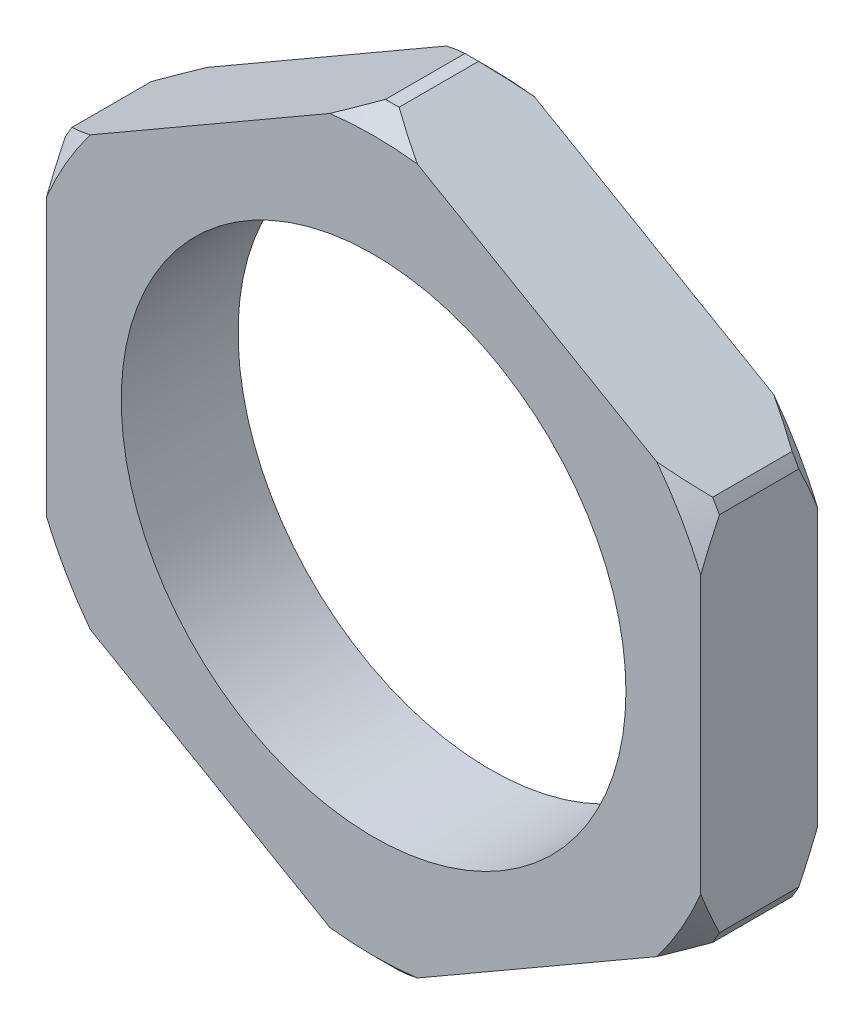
ISO-10303-21;
HEADER;
FILE_DESCRIPTION(('STEP AP214'),'2;1');
FILE_NAME('part.step','',(''),(''),'','','');
FILE_SCHEMA(('AUTOMOTIVE_DESIGN { 1 0 10303 214 1 1 1 1 }'));
ENDSEC;
DATA;
#1=APPLICATION_CONTEXT('core data for automotive mechanical design processes');
#2=APPLICATION_PROTOCOL_DEFINITION('international standard','automotive_design',2000,#1);
#3=PRODUCT_CONTEXT('',#1,'mechanical');
#4=PRODUCT('Part','Part','',(#3));
#5=PRODUCT_RELATED_PRODUCT_CATEGORY('part','',(#4));
#6=PRODUCT_DEFINITION_FORMATION('','',#4);
#7=PRODUCT_DEFINITION_CONTEXT('part definition',#1,'design');
#8=PRODUCT_DEFINITION('design','',#6,#7);
#9=PRODUCT_DEFINITION_SHAPE('','',#8);
#10=(LENGTH_UNIT() NAMED_UNIT(*) SI_UNIT(.MILLI.,.METRE.));
#11=(NAMED_UNIT(*) PLANE_ANGLE_UNIT() SI_UNIT($,.RADIAN.));
#12=(NAMED_UNIT(*) SI_UNIT($,.STERADIAN.) SOLID_ANGLE_UNIT());
#13=UNCERTAINTY_MEASURE_WITH_UNIT(LENGTH_MEASURE(1.E-05),#10,'distance_accuracy_value','');
#14=(GEOMETRIC_REPRESENTATION_CONTEXT(3) GLOBAL_UNCERTAINTY_ASSIGNED_CONTEXT((#13)) GLOBAL_UNIT_ASSIGNED_CONTEXT((#10,
#11,#12)) REPRESENTATION_CONTEXT('',''));
#15=CARTESIAN_POINT('',(0.,0.,0.));
#16=DIRECTION('',(0.,0.,1.));
#17=DIRECTION('',(1.,0.,0.));
#18=AXIS2_PLACEMENT_3D('',#15,#16,#17);
#19=CARTESIAN_POINT('',(0.,0.,2.5));
#20=DIRECTION('',(0.,0.,-1.));
#21=DIRECTION('',(-1.,0.,0.));
#22=AXIS2_PLACEMENT_3D('',#19,#20,#21);
#23=CYLINDRICAL_SURFACE('',#22,8.);
#24=DIRECTION('',(0.,0.,-1.));
#25=VECTOR('',#24,1.);
#26=CARTESIAN_POINT('',(6.85410196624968,4.12568615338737,2.5));
#27=LINE('',#26,#25);
#28=CARTESIAN_POINT('',(6.85410196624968,4.12568615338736,2.1));
#29=VERTEX_POINT('',#28);
#30=CARTESIAN_POINT('',(6.85410196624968,4.12568615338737,0.400000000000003));
#31=VERTEX_POINT('',#30);
#32=EDGE_CURVE('E425',#29,#31,#27,.T.);
#33=ORIENTED_EDGE('',*,*,#32,.F.);
#34=CARTESIAN_POINT('',(0.,0.,2.1));
#35=DIRECTION('',(0.,0.,1.));
#36=DIRECTION('',(1.,0.,0.));
#37=AXIS2_PLACEMENT_3D('',#34,#35,#36);
#38=CIRCLE('',#37,8.);
#39=CARTESIAN_POINT('',(7.,3.87298334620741,2.1));
#40=VERTEX_POINT('',#39);
#41=EDGE_CURVE('E420',#29,#40,#38,.F.);
#42=ORIENTED_EDGE('',*,*,#41,.T.);
#43=DIRECTION('',(0.,0.,-1.));
#44=VECTOR('',#43,1.);
#45=CARTESIAN_POINT('',(7.,3.87298334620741,2.5));
#46=LINE('',#45,#44);
#47=CARTESIAN_POINT('',(7.,3.87298334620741,0.400000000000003));
#48=VERTEX_POINT('',#47);
#49=EDGE_CURVE('E72',#48,#40,#46,.F.);
#50=ORIENTED_EDGE('',*,*,#49,.F.);
#51=CARTESIAN_POINT('',(0.,0.,0.400000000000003));
#52=DIRECTION('',(0.,0.,1.));
#53=DIRECTION('',(1.,0.,0.));
#54=AXIS2_PLACEMENT_3D('',#51,#52,#53);
#55=CIRCLE('',#54,8.);
#56=EDGE_CURVE('E426',#48,#31,#55,.T.);
#57=ORIENTED_EDGE('',*,*,#56,.T.);
#58=EDGE_LOOP('',(#33,#42,#50,#57));
#59=FACE_BOUND('',#58,.T.);
#60=ADVANCED_FACE('F50',(#59),#23,.T.);
#61=DIRECTION('',(0.,0.,-1.));
#62=VECTOR('',#61,1.);
#63=CARTESIAN_POINT('',(0.145898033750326,7.99866949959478,2.5));
#64=LINE('',#63,#62);
#65=CARTESIAN_POINT('',(0.145898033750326,7.99866949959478,0.400000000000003));
#66=VERTEX_POINT('',#65);
#67=CARTESIAN_POINT('',(0.145898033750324,7.99866949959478,2.1));
#68=VERTEX_POINT('',#67);
#69=EDGE_CURVE('E80',#66,#68,#64,.F.);
#70=ORIENTED_EDGE('',*,*,#69,.F.);
#71=CARTESIAN_POINT('',(-0.145898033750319,7.99866949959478,0.400000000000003));
#72=VERTEX_POINT('',#71);
#73=EDGE_CURVE('E429',#66,#72,#55,.T.);
#74=ORIENTED_EDGE('',*,*,#73,.T.);
#75=DIRECTION('',(0.,0.,-1.));
#76=VECTOR('',#75,1.);
#77=CARTESIAN_POINT('',(-0.145898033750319,7.99866949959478,2.5));
#78=LINE('',#77,#76);
#79=CARTESIAN_POINT('',(-0.145898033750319,7.99866949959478,2.1));
#80=VERTEX_POINT('',#79);
#81=EDGE_CURVE('E282',#80,#72,#78,.T.);
#82=ORIENTED_EDGE('',*,*,#81,.F.);
#83=EDGE_CURVE('E237',#80,#68,#38,.F.);
#84=ORIENTED_EDGE('',*,*,#83,.T.);
#85=EDGE_LOOP('',(#70,#74,#82,#84));
#86=FACE_BOUND('',#85,.T.);
#87=ADVANCED_FACE('F384',(#86),#23,.T.);
#88=DIRECTION('',(0.,0.,-1.));
#89=VECTOR('',#88,1.);
#90=CARTESIAN_POINT('',(7.,-3.87298334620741,2.5));
#91=LINE('',#90,#89);
#92=CARTESIAN_POINT('',(7.,-3.87298334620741,2.1));
#93=VERTEX_POINT('',#92);
#94=CARTESIAN_POINT('',(7.,-3.87298334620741,0.400000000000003));
#95=VERTEX_POINT('',#94);
#96=EDGE_CURVE('E339',#93,#95,#91,.T.);
#97=ORIENTED_EDGE('',*,*,#96,.F.);
#98=CARTESIAN_POINT('',(6.85410196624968,-4.12568615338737,2.1));
#99=VERTEX_POINT('',#98);
#100=EDGE_CURVE('E421',#93,#99,#38,.F.);
#101=ORIENTED_EDGE('',*,*,#100,.T.);
#102=DIRECTION('',(0.,0.,-1.));
#103=VECTOR('',#102,1.);
#104=CARTESIAN_POINT('',(6.85410196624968,-4.12568615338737,2.5));
#105=LINE('',#104,#103);
#106=CARTESIAN_POINT('',(6.85410196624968,-4.12568615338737,0.400000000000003));
#107=VERTEX_POINT('',#106);
#108=EDGE_CURVE('E462',#107,#99,#105,.F.);
#109=ORIENTED_EDGE('',*,*,#108,.F.);
#110=EDGE_CURVE('E424',#107,#95,#55,.T.);
#111=ORIENTED_EDGE('',*,*,#110,.T.);
#112=EDGE_LOOP('',(#97,#101,#109,#111));
#113=FACE_BOUND('',#112,.T.);
#114=ADVANCED_FACE('F390',(#113),#23,.T.);
#115=DIRECTION('',(0.,0.,-1.));
#116=VECTOR('',#115,1.);
#117=CARTESIAN_POINT('',(0.145898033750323,-7.99866949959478,2.5));
#118=LINE('',#117,#116);
#119=CARTESIAN_POINT('',(0.145898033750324,-7.99866949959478,2.1));
#120=VERTEX_POINT('',#119);
#121=CARTESIAN_POINT('',(0.145898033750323,-7.99866949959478,0.400000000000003));
#122=VERTEX_POINT('',#121);
#123=EDGE_CURVE('E720',#120,#122,#118,.T.);
#124=ORIENTED_EDGE('',*,*,#123,.F.);
#125=CARTESIAN_POINT('',(-0.145898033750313,-7.99866949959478,2.1));
#126=VERTEX_POINT('',#125);
#127=EDGE_CURVE('E419',#120,#126,#38,.F.);
#128=ORIENTED_EDGE('',*,*,#127,.T.);
#129=DIRECTION('',(0.,0.,-1.));
#130=VECTOR('',#129,1.);
#131=CARTESIAN_POINT('',(-0.145898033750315,-7.99866949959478,2.5));
#132=LINE('',#131,#130);
#133=CARTESIAN_POINT('',(-0.145898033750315,-7.99866949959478,0.400000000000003));
#134=VERTEX_POINT('',#133);
#135=EDGE_CURVE('E464',#134,#126,#132,.F.);
#136=ORIENTED_EDGE('',*,*,#135,.F.);
#137=EDGE_CURVE('E435',#134,#122,#55,.T.);
#138=ORIENTED_EDGE('',*,*,#137,.T.);
#139=EDGE_LOOP('',(#124,#128,#136,#138));
#140=FACE_BOUND('',#139,.T.);
#141=ADVANCED_FACE('F401',(#140),#23,.T.);
#142=DIRECTION('',(0.,0.,-1.));
#143=VECTOR('',#142,1.);
#144=CARTESIAN_POINT('',(-6.85410196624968,-4.12568615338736,2.5));
#145=LINE('',#144,#143);
#146=CARTESIAN_POINT('',(-6.85410196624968,-4.12568615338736,2.1));
#147=VERTEX_POINT('',#146);
#148=CARTESIAN_POINT('',(-6.85410196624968,-4.12568615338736,0.400000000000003));
#149=VERTEX_POINT('',#148);
#150=EDGE_CURVE('E450',#147,#149,#145,.T.);
#151=ORIENTED_EDGE('',*,*,#150,.F.);
#152=CARTESIAN_POINT('',(-7.,-3.87298334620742,2.1));
#153=VERTEX_POINT('',#152);
#154=EDGE_CURVE('E416',#147,#153,#38,.F.);
#155=ORIENTED_EDGE('',*,*,#154,.T.);
#156=DIRECTION('',(0.,0.,-1.));
#157=VECTOR('',#156,1.);
#158=CARTESIAN_POINT('',(-7.,-3.87298334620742,2.5));
#159=LINE('',#158,#157);
#160=CARTESIAN_POINT('',(-7.,-3.87298334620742,0.400000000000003));
#161=VERTEX_POINT('',#160);
#162=EDGE_CURVE('E452',#161,#153,#159,.F.);
#163=ORIENTED_EDGE('',*,*,#162,.F.);
#164=EDGE_CURVE('E441',#161,#149,#55,.T.);
#165=ORIENTED_EDGE('',*,*,#164,.T.);
#166=EDGE_LOOP('',(#151,#155,#163,#165));
#167=FACE_BOUND('',#166,.T.);
#168=ADVANCED_FACE('F394',(#167),#23,.T.);
#169=DIRECTION('',(0.,0.,-1.));
#170=VECTOR('',#169,1.);
#171=CARTESIAN_POINT('',(-7.,3.87298334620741,2.5));
#172=LINE('',#171,#170);
#173=CARTESIAN_POINT('',(-7.,3.87298334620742,2.1));
#174=VERTEX_POINT('',#173);
#175=CARTESIAN_POINT('',(-7.,3.87298334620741,0.400000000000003));
#176=VERTEX_POINT('',#175);
#177=EDGE_CURVE('E406',#174,#176,#172,.T.);
#178=ORIENTED_EDGE('',*,*,#177,.F.);
#179=CARTESIAN_POINT('',(-6.85410196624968,4.12568615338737,2.1));
#180=VERTEX_POINT('',#179);
#181=EDGE_CURVE('E409',#174,#180,#38,.F.);
#182=ORIENTED_EDGE('',*,*,#181,.T.);
#183=DIRECTION('',(0.,0.,-1.));
#184=VECTOR('',#183,1.);
#185=CARTESIAN_POINT('',(-6.85410196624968,4.12568615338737,2.5));
#186=LINE('',#185,#184);
#187=CARTESIAN_POINT('',(-6.85410196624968,4.12568615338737,0.400000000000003));
#188=VERTEX_POINT('',#187);
#189=EDGE_CURVE('E283',#188,#180,#186,.F.);
#190=ORIENTED_EDGE('',*,*,#189,.F.);
#191=EDGE_CURVE('E411',#188,#176,#55,.T.);
#192=ORIENTED_EDGE('',*,*,#191,.T.);
#193=EDGE_LOOP('',(#178,#182,#190,#192));
#194=FACE_BOUND('',#193,.T.);
#195=ADVANCED_FACE('F386',(#194),#23,.T.);
#196=CARTESIAN_POINT('',(0.,0.,2.5));
#197=DIRECTION('',(0.,0.,1.));
#198=DIRECTION('',(1.,0.,0.));
#199=AXIS2_PLACEMENT_3D('',#196,#197,#198);
#200=PLANE('',#199);
#201=CARTESIAN_POINT('',(0.,0.,2.5));
#202=DIRECTION('',(0.,0.,1.));
#203=DIRECTION('',(1.,0.,0.));
#204=AXIS2_PLACEMENT_3D('',#201,#202,#203);
#205=CIRCLE('',#204,5.4);
#206=CARTESIAN_POINT('',(5.4,0.,2.5));
#207=VERTEX_POINT('',#206);
#208=EDGE_CURVE('E517',#207,#207,#205,.T.);
#209=ORIENTED_EDGE('',*,*,#208,.F.);
#210=EDGE_LOOP('',(#209));
#211=FACE_BOUND('',#210,.T.);
#212=CARTESIAN_POINT('',(0.,0.,2.5));
#213=DIRECTION('',(0.,0.,1.));
#214=DIRECTION('',(1.,0.,0.));
#215=AXIS2_PLACEMENT_3D('',#212,#213,#214);
#216=CIRCLE('',#215,7.6);
#217=CARTESIAN_POINT('',(7.,2.95972971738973,2.5));
#218=VERTEX_POINT('',#217);
#219=CARTESIAN_POINT('',(6.06320112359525,4.5823129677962,2.5));
#220=VERTEX_POINT('',#219);
#221=EDGE_CURVE('E243',#218,#220,#216,.T.);
#222=ORIENTED_EDGE('',*,*,#221,.T.);
#223=DIRECTION('',(-0.866025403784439,0.5,0.));
#224=VECTOR('',#223,1.);
#225=CARTESIAN_POINT('',(7.,4.04145188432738,2.5));
#226=LINE('',#225,#224);
#227=CARTESIAN_POINT('',(0.936798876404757,7.54204268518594,2.5));
#228=VERTEX_POINT('',#227);
#229=EDGE_CURVE('E229',#220,#228,#226,.T.);
#230=ORIENTED_EDGE('',*,*,#229,.T.);
#231=CARTESIAN_POINT('',(-0.936798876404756,7.54204268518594,2.5));
#232=VERTEX_POINT('',#231);
#233=EDGE_CURVE('E235',#228,#232,#216,.T.);
#234=ORIENTED_EDGE('',*,*,#233,.T.);
#235=DIRECTION('',(-0.866025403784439,-0.5,0.));
#236=VECTOR('',#235,1.);
#237=CARTESIAN_POINT('',(0.,8.08290376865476,2.5));
#238=LINE('',#237,#236);
#239=CARTESIAN_POINT('',(-6.06320112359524,4.58231296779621,2.5));
#240=VERTEX_POINT('',#239);
#241=EDGE_CURVE('E217',#232,#240,#238,.T.);
#242=ORIENTED_EDGE('',*,*,#241,.T.);
#243=CARTESIAN_POINT('',(-7.,2.95972971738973,2.5));
#244=VERTEX_POINT('',#243);
#245=EDGE_CURVE('E244',#240,#244,#216,.T.);
#246=ORIENTED_EDGE('',*,*,#245,.T.);
#247=DIRECTION('',(0.,-1.,0.));
#248=VECTOR('',#247,1.);
#249=CARTESIAN_POINT('',(-7.,4.04145188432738,2.5));
#250=LINE('',#249,#248);
#251=CARTESIAN_POINT('',(-7.,-2.95972971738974,2.5));
#252=VERTEX_POINT('',#251);
#253=EDGE_CURVE('E228',#244,#252,#250,.T.);
#254=ORIENTED_EDGE('',*,*,#253,.T.);
#255=CARTESIAN_POINT('',(-6.06320112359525,-4.5823129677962,2.5));
#256=VERTEX_POINT('',#255);
#257=EDGE_CURVE('E247',#252,#256,#216,.T.);
#258=ORIENTED_EDGE('',*,*,#257,.T.);
#259=DIRECTION('',(0.866025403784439,-0.5,0.));
#260=VECTOR('',#259,1.);
#261=CARTESIAN_POINT('',(-7.,-4.04145188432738,2.5));
#262=LINE('',#261,#260);
#263=CARTESIAN_POINT('',(-0.936798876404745,-7.54204268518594,2.5));
#264=VERTEX_POINT('',#263);
#265=EDGE_CURVE('E503',#256,#264,#262,.T.);
#266=ORIENTED_EDGE('',*,*,#265,.T.);
#267=CARTESIAN_POINT('',(0.936798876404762,-7.54204268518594,2.5));
#268=VERTEX_POINT('',#267);
#269=EDGE_CURVE('E493',#264,#268,#216,.T.);
#270=ORIENTED_EDGE('',*,*,#269,.T.);
#271=DIRECTION('',(0.866025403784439,0.5,0.));
#272=VECTOR('',#271,1.);
#273=CARTESIAN_POINT('',(0.,-8.08290376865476,2.5));
#274=LINE('',#273,#272);
#275=CARTESIAN_POINT('',(6.06320112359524,-4.58231296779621,2.5));
#276=VERTEX_POINT('',#275);
#277=EDGE_CURVE('E507',#268,#276,#274,.T.);
#278=ORIENTED_EDGE('',*,*,#277,.T.);
#279=CARTESIAN_POINT('',(7.,-2.95972971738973,2.5));
#280=VERTEX_POINT('',#279);
#281=EDGE_CURVE('E246',#276,#280,#216,.T.);
#282=ORIENTED_EDGE('',*,*,#281,.T.);
#283=DIRECTION('',(0.,1.,0.));
#284=VECTOR('',#283,1.);
#285=CARTESIAN_POINT('',(7.,-4.04145188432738,2.5));
#286=LINE('',#285,#284);
#287=EDGE_CURVE('E509',#280,#218,#286,.T.);
#288=ORIENTED_EDGE('',*,*,#287,.T.);
#289=EDGE_LOOP('',(#222,#230,#234,#242,#246,#254,#258,#266,#270,#278,#282,#288));
#290=FACE_BOUND('',#289,.T.);
#291=ADVANCED_FACE('F242',(#211,#290),#200,.T.);
#292=CARTESIAN_POINT('',(0.,0.,0.));
#293=DIRECTION('',(0.,0.,1.));
#294=DIRECTION('',(1.,0.,0.));
#295=AXIS2_PLACEMENT_3D('',#292,#293,#294);
#296=PLANE('',#295);
#297=CARTESIAN_POINT('',(0.,0.,0.));
#298=DIRECTION('',(0.,0.,1.));
#299=DIRECTION('',(1.,0.,0.));
#300=AXIS2_PLACEMENT_3D('',#297,#298,#299);
#301=CIRCLE('',#300,5.4);
#302=CARTESIAN_POINT('',(5.4,0.,0.));
#303=VERTEX_POINT('',#302);
#304=EDGE_CURVE('E527',#303,#303,#301,.T.);
#305=ORIENTED_EDGE('',*,*,#304,.T.);
#306=EDGE_LOOP('',(#305));
#307=FACE_BOUND('',#306,.T.);
#308=DIRECTION('',(-0.866025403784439,0.5,0.));
#309=VECTOR('',#308,1.);
#310=CARTESIAN_POINT('',(7.,4.04145188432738,0.));
#311=LINE('',#310,#309);
#312=CARTESIAN_POINT('',(6.06320112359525,4.5823129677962,0.));
#313=VERTEX_POINT('',#312);
#314=CARTESIAN_POINT('',(0.936798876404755,7.54204268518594,0.));
#315=VERTEX_POINT('',#314);
#316=EDGE_CURVE('E481',#313,#315,#311,.T.);
#317=ORIENTED_EDGE('',*,*,#316,.F.);
#318=CARTESIAN_POINT('',(0.,0.,0.));
#319=DIRECTION('',(0.,0.,1.));
#320=DIRECTION('',(1.,0.,0.));
#321=AXIS2_PLACEMENT_3D('',#318,#319,#320);
#322=CIRCLE('',#321,7.6);
#323=CARTESIAN_POINT('',(7.,2.95972971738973,0.));
#324=VERTEX_POINT('',#323);
#325=EDGE_CURVE('E428',#313,#324,#322,.F.);
#326=ORIENTED_EDGE('',*,*,#325,.T.);
#327=DIRECTION('',(0.,1.,0.));
#328=VECTOR('',#327,1.);
#329=CARTESIAN_POINT('',(7.,-4.04145188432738,0.));
#330=LINE('',#329,#328);
#331=CARTESIAN_POINT('',(7.,-2.95972971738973,0.));
#332=VERTEX_POINT('',#331);
#333=EDGE_CURVE('E525',#332,#324,#330,.T.);
#334=ORIENTED_EDGE('',*,*,#333,.F.);
#335=CARTESIAN_POINT('',(6.06320112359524,-4.58231296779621,0.));
#336=VERTEX_POINT('',#335);
#337=EDGE_CURVE('E249',#332,#336,#322,.F.);
#338=ORIENTED_EDGE('',*,*,#337,.T.);
#339=DIRECTION('',(0.866025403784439,0.5,0.));
#340=VECTOR('',#339,1.);
#341=CARTESIAN_POINT('',(0.,-8.08290376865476,0.));
#342=LINE('',#341,#340);
#343=CARTESIAN_POINT('',(0.936798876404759,-7.54204268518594,0.));
#344=VERTEX_POINT('',#343);
#345=EDGE_CURVE('E523',#344,#336,#342,.T.);
#346=ORIENTED_EDGE('',*,*,#345,.F.);
#347=CARTESIAN_POINT('',(-0.936798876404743,-7.54204268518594,0.));
#348=VERTEX_POINT('',#347);
#349=EDGE_CURVE('E487',#344,#348,#322,.F.);
#350=ORIENTED_EDGE('',*,*,#349,.T.);
#351=DIRECTION('',(0.866025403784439,-0.5,0.));
#352=VECTOR('',#351,1.);
#353=CARTESIAN_POINT('',(-7.,-4.04145188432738,0.));
#354=LINE('',#353,#352);
#355=CARTESIAN_POINT('',(-6.06320112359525,-4.5823129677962,0.));
#356=VERTEX_POINT('',#355);
#357=EDGE_CURVE('E521',#356,#348,#354,.T.);
#358=ORIENTED_EDGE('',*,*,#357,.F.);
#359=CARTESIAN_POINT('',(-7.,-2.95972971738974,0.));
#360=VERTEX_POINT('',#359);
#361=EDGE_CURVE('E460',#356,#360,#322,.F.);
#362=ORIENTED_EDGE('',*,*,#361,.T.);
#363=DIRECTION('',(0.,-1.,0.));
#364=VECTOR('',#363,1.);
#365=CARTESIAN_POINT('',(-7.,4.04145188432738,0.));
#366=LINE('',#365,#364);
#367=CARTESIAN_POINT('',(-7.,2.95972971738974,0.));
#368=VERTEX_POINT('',#367);
#369=EDGE_CURVE('E514',#368,#360,#366,.T.);
#370=ORIENTED_EDGE('',*,*,#369,.F.);
#371=CARTESIAN_POINT('',(-6.06320112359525,4.58231296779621,0.));
#372=VERTEX_POINT('',#371);
#373=EDGE_CURVE('E485',#368,#372,#322,.F.);
#374=ORIENTED_EDGE('',*,*,#373,.T.);
#375=DIRECTION('',(-0.866025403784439,-0.5,0.));
#376=VECTOR('',#375,1.);
#377=CARTESIAN_POINT('',(0.,8.08290376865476,0.));
#378=LINE('',#377,#376);
#379=CARTESIAN_POINT('',(-0.936798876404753,7.54204268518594,0.));
#380=VERTEX_POINT('',#379);
#381=EDGE_CURVE('E484',#380,#372,#378,.T.);
#382=ORIENTED_EDGE('',*,*,#381,.F.);
#383=EDGE_CURVE('E432',#380,#315,#322,.F.);
#384=ORIENTED_EDGE('',*,*,#383,.T.);
#385=EDGE_LOOP('',(#317,#326,#334,#338,#346,#350,#358,#362,#370,#374,#382,#384));
#386=FACE_BOUND('',#385,.T.);
#387=ADVANCED_FACE('F295',(#307,#386),#296,.F.);
#388=CARTESIAN_POINT('',(0.,0.,0.400000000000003));
#389=DIRECTION('',(0.,0.,1.));
#390=DIRECTION('',(1.,0.,0.));
#391=AXIS2_PLACEMENT_3D('',#388,#389,#390);
#392=CONICAL_SURFACE('',#391,8.,0.785398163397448);
#393=ORIENTED_EDGE('',*,*,#73,.F.);
#394=CARTESIAN_POINT('',(0.144646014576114,7.99939235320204,0.400700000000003));
#395=CARTESIAN_POINT('',(0.260798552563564,7.93233165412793,0.335758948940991));
#396=CARTESIAN_POINT('',(0.377823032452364,7.86476753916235,0.272893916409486));
#397=CARTESIAN_POINT('',(0.613766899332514,7.72854528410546,0.151915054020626));
#398=CARTESIAN_POINT('',(0.732687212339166,7.65988660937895,0.0938036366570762));
#399=CARTESIAN_POINT('',(1.09348058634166,7.45158245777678,-0.0729312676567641));
#400=CARTESIAN_POINT('',(1.33828379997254,7.31024525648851,-0.173325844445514));
#401=CARTESIAN_POINT('',(1.83183194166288,7.02529510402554,-0.344803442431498));
#402=CARTESIAN_POINT('',(2.08046910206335,6.88174437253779,-0.416288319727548));
#403=CARTESIAN_POINT('',(2.45720328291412,6.66423679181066,-0.498619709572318));
#404=CARTESIAN_POINT('',(2.58330119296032,6.59143412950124,-0.521904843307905));
#405=CARTESIAN_POINT('',(2.83647219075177,6.44526578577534,-0.559685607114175));
#406=CARTESIAN_POINT('',(2.96354515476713,6.37190017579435,-0.574182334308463));
#407=CARTESIAN_POINT('',(3.28037427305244,6.18897879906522,-0.598802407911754));
#408=CARTESIAN_POINT('',(3.4704793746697,6.07922156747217,-0.603345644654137));
#409=CARTESIAN_POINT('',(3.85025524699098,5.85995786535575,-0.591756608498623));
#410=CARTESIAN_POINT('',(4.03992585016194,5.75045149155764,-0.575617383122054));
#411=CARTESIAN_POINT('',(4.4173782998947,5.53252921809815,-0.523615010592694));
#412=CARTESIAN_POINT('',(4.60515817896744,5.42411445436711,-0.487733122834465));
#413=CARTESIAN_POINT('',(4.97744972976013,5.20917182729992,-0.39817761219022));
#414=CARTESIAN_POINT('',(5.16196168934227,5.10264379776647,-0.344505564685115));
#415=CARTESIAN_POINT('',(5.47473387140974,4.92206469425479,-0.239381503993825));
#416=CARTESIAN_POINT('',(5.60396477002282,4.84745320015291,-0.191699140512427));
#417=CARTESIAN_POINT('',(5.86034050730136,4.69943459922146,-0.0894080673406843));
#418=CARTESIAN_POINT('',(5.98748549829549,4.62602740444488,-0.0347998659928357));
#419=CARTESIAN_POINT('',(6.23927167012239,4.48065859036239,0.0803015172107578));
#420=CARTESIAN_POINT('',(6.36391960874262,4.40869306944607,0.14077513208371));
#421=CARTESIAN_POINT('',(6.61115417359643,4.26595212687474,0.266979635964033));
#422=CARTESIAN_POINT('',(6.73374151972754,4.19517628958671,0.332708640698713));
#423=CARTESIAN_POINT('',(6.85535398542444,4.12496329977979,0.40070000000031));
#424=B_SPLINE_CURVE_WITH_KNOTS('',3,(#394,#395,#396,#397,#398,#399,#400,#401,#402,#403,#404,
#405,#406,#407,#408,#409,#410,#411,#412,#413,#414,#415,#416,#417,#418,#419,#420,#421,#422,#423),
.UNSPECIFIED.,.F.,.F.,(4,2,2,2,2,2,2,2,2,2,2,2,2,2,4),(0.,0.447022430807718,0.894270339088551,
1.79301544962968,2.67879864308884,3.12093161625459,3.56300938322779,4.22066809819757,
4.87854794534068,5.53705336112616,6.19550047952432,6.66529864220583,7.13506234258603,
7.60330955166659,8.07138962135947),.UNSPECIFIED.);
#425=EDGE_CURVE('E476',#66,#315,#424,.T.);
#426=ORIENTED_EDGE('',*,*,#425,.T.);
#427=ORIENTED_EDGE('',*,*,#383,.F.);
#428=CARTESIAN_POINT('',(-6.85535398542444,4.12496329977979,0.40070000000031));
#429=CARTESIAN_POINT('',(-6.73920144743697,4.19202399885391,0.33575894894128));
#430=CARTESIAN_POINT('',(-6.62217696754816,4.2595881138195,0.272893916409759));
#431=CARTESIAN_POINT('',(-6.38623310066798,4.39581036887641,0.151915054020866));
#432=CARTESIAN_POINT('',(-6.26731278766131,4.46446904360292,0.093803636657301));
#433=CARTESIAN_POINT('',(-5.90651941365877,4.67277319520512,-0.0729312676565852));
#434=CARTESIAN_POINT('',(-5.66171620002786,4.81411039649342,-0.173325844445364));
#435=CARTESIAN_POINT('',(-5.16816805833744,5.09906054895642,-0.3448034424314));
#436=CARTESIAN_POINT('',(-4.91953089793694,5.24261128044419,-0.416288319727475));
#437=CARTESIAN_POINT('',(-4.54279671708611,5.46011886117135,-0.498619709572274));
#438=CARTESIAN_POINT('',(-4.41669880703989,5.53292152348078,-0.52190484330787));
#439=CARTESIAN_POINT('',(-4.1635278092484,5.67908986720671,-0.559685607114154));
#440=CARTESIAN_POINT('',(-4.03645484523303,5.75245547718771,-0.574182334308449));
#441=CARTESIAN_POINT('',(-3.7196257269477,5.93537685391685,-0.59880240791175));
#442=CARTESIAN_POINT('',(-3.52952062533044,6.0451340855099,-0.603345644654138));
#443=CARTESIAN_POINT('',(-3.14974475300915,6.26439778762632,-0.591756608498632));
#444=CARTESIAN_POINT('',(-2.96007414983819,6.37390416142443,-0.575617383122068));
#445=CARTESIAN_POINT('',(-2.58262170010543,6.59182643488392,-0.523615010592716));
#446=CARTESIAN_POINT('',(-2.39484182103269,6.70024119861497,-0.487733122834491));
#447=CARTESIAN_POINT('',(-2.02255027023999,6.91518382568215,-0.398177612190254));
#448=CARTESIAN_POINT('',(-1.83803831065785,7.02171185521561,-0.344505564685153));
#449=CARTESIAN_POINT('',(-1.52526612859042,7.20229095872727,-0.23938150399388));
#450=CARTESIAN_POINT('',(-1.39603522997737,7.27690245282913,-0.1916991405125));
#451=CARTESIAN_POINT('',(-1.13965949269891,7.42492105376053,-0.0894080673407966));
#452=CARTESIAN_POINT('',(-1.01251450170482,7.49832824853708,-0.0347998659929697));
#453=CARTESIAN_POINT('',(-0.760728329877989,7.64369706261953,0.0803015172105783));
#454=CARTESIAN_POINT('',(-0.636080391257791,7.71566258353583,0.140775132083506));
#455=CARTESIAN_POINT('',(-0.388845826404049,7.85840352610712,0.266979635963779));
#456=CARTESIAN_POINT('',(-0.266258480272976,7.92917936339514,0.332708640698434));
#457=CARTESIAN_POINT('',(-0.144646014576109,7.99939235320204,0.400700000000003));
#458=B_SPLINE_CURVE_WITH_KNOTS('',3,(#428,#429,#430,#431,#432,#433,#434,#435,#436,#437,#438,
#439,#440,#441,#442,#443,#444,#445,#446,#447,#448,#449,#450,#451,#452,#453,#454,#455,#456,#457),
.UNSPECIFIED.,.F.,.F.,(4,2,2,2,2,2,2,2,2,2,2,2,2,2,4),(0.,0.447022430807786,0.894270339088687,
1.79301544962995,2.67879864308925,3.12093161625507,3.56300938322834,4.22066809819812,
4.87854794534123,5.53705336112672,6.19550047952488,6.66529864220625,7.13506234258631,
7.60330955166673,8.07138962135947),.UNSPECIFIED.);
#459=EDGE_CURVE('E284',#380,#72,#458,.T.);
#460=ORIENTED_EDGE('',*,*,#459,.T.);
#461=EDGE_LOOP('',(#393,#426,#427,#460));
#462=FACE_BOUND('',#461,.T.);
#463=ADVANCED_FACE('F288',(#462),#392,.T.);
#464=ORIENTED_EDGE('',*,*,#325,.F.);
#465=EDGE_CURVE('E478',#313,#31,#424,.T.);
#466=ORIENTED_EDGE('',*,*,#465,.T.);
#467=ORIENTED_EDGE('',*,*,#56,.F.);
#468=CARTESIAN_POINT('',(7.,3.87442905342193,0.400700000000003));
#469=CARTESIAN_POINT('',(7.,3.74030765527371,0.33575894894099));
#470=CARTESIAN_POINT('',(7.,3.60517942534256,0.272893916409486));
#471=CARTESIAN_POINT('',(7.,3.33273491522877,0.151915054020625));
#472=CARTESIAN_POINT('',(7.,3.19541756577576,0.0938036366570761));
#473=CARTESIAN_POINT('',(7.,2.77880926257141,-0.0729312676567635));
#474=CARTESIAN_POINT('',(7.,2.49613485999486,-0.173325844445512));
#475=CARTESIAN_POINT('',(7.,1.92623455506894,-0.344803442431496));
#476=CARTESIAN_POINT('',(7.,1.63913309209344,-0.416288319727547));
#477=CARTESIAN_POINT('',(7.,1.20411793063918,-0.498619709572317));
#478=CARTESIAN_POINT('',(7.,1.05851260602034,-0.521904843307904));
#479=CARTESIAN_POINT('',(7.,0.766175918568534,-0.559685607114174));
#480=CARTESIAN_POINT('',(7.,0.619444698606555,-0.574182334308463));
#481=CARTESIAN_POINT('',(7.,0.253601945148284,-0.598802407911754));
#482=CARTESIAN_POINT('',(7.,0.0340874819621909,-0.603345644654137));
#483=CARTESIAN_POINT('',(7.,-0.404439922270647,-0.591756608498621));
#484=CARTESIAN_POINT('',(7.,-0.623452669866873,-0.575617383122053));
#485=CARTESIAN_POINT('',(7.,-1.05929721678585,-0.523615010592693));
#486=CARTESIAN_POINT('',(7.,-1.27612674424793,-0.487733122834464));
#487=CARTESIAN_POINT('',(7.,-1.7060119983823,-0.398177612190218));
#488=CARTESIAN_POINT('',(7.,-1.91906805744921,-0.344505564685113));
#489=CARTESIAN_POINT('',(7.,-2.28022626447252,-0.239381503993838));
#490=CARTESIAN_POINT('',(7.,-2.42944925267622,-0.191699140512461));
#491=CARTESIAN_POINT('',(7.,-2.72548645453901,-0.0894080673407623));
#492=CARTESIAN_POINT('',(7.,-2.8723008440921,-0.0347998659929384));
#493=CARTESIAN_POINT('',(7.,-3.16303847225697,0.0803015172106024));
#494=CARTESIAN_POINT('',(7.,-3.30696951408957,0.140775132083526));
#495=CARTESIAN_POINT('',(7.,-3.59245139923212,0.26697963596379));
#496=CARTESIAN_POINT('',(7.,-3.73400307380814,0.332708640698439));
#497=CARTESIAN_POINT('',(7.,-3.87442905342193,0.400700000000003));
#498=B_SPLINE_CURVE_WITH_KNOTS('',3,(#468,#469,#470,#471,#472,#473,#474,#475,#476,#477,#478,
#479,#480,#481,#482,#483,#484,#485,#486,#487,#488,#489,#490,#491,#492,#493,#494,#495,#496,#497),
.UNSPECIFIED.,.F.,.F.,(4,2,2,2,2,2,2,2,2,2,2,2,2,2,4),(0.,0.447022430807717,0.89427033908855,
1.79301544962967,2.67879864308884,3.12093161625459,3.56300938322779,4.22066809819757,
4.87854794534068,5.53705336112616,6.19550047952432,6.66529864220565,7.13506234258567,
7.60330955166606,8.07138962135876),.UNSPECIFIED.);
#499=EDGE_CURVE('E330',#48,#324,#498,.T.);
#500=ORIENTED_EDGE('',*,*,#499,.T.);
#501=EDGE_LOOP('',(#464,#466,#467,#500));
#502=FACE_BOUND('',#501,.T.);
#503=ADVANCED_FACE('F294',(#502),#392,.T.);
#504=ORIENTED_EDGE('',*,*,#337,.F.);
#505=EDGE_CURVE('E340',#332,#95,#498,.T.);
#506=ORIENTED_EDGE('',*,*,#505,.T.);
#507=ORIENTED_EDGE('',*,*,#110,.F.);
#508=CARTESIAN_POINT('',(6.85535398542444,-4.12496329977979,0.400700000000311));
#509=CARTESIAN_POINT('',(6.73920144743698,-4.19202399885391,0.335758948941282));
#510=CARTESIAN_POINT('',(6.62217696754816,-4.2595881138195,0.272893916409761));
#511=CARTESIAN_POINT('',(6.38623310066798,-4.39581036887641,0.151915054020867));
#512=CARTESIAN_POINT('',(6.26731278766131,-4.46446904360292,0.0938036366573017));
#513=CARTESIAN_POINT('',(5.90651941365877,-4.67277319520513,-0.0729312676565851));
#514=CARTESIAN_POINT('',(5.66171620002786,-4.81411039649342,-0.173325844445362));
#515=CARTESIAN_POINT('',(5.16816805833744,-5.09906054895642,-0.344803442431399));
#516=CARTESIAN_POINT('',(4.91953089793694,-5.24261128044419,-0.416288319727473));
#517=CARTESIAN_POINT('',(4.54279671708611,-5.46011886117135,-0.498619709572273));
#518=CARTESIAN_POINT('',(4.41669880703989,-5.53292152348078,-0.521904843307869));
#519=CARTESIAN_POINT('',(4.1635278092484,-5.67908986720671,-0.559685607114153));
#520=CARTESIAN_POINT('',(4.03645484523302,-5.75245547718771,-0.574182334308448));
#521=CARTESIAN_POINT('',(3.71962572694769,-5.93537685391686,-0.598802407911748));
#522=CARTESIAN_POINT('',(3.52952062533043,-6.0451340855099,-0.603345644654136));
#523=CARTESIAN_POINT('',(3.14974475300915,-6.26439778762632,-0.591756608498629));
#524=CARTESIAN_POINT('',(2.96007414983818,-6.37390416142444,-0.575617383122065));
#525=CARTESIAN_POINT('',(2.58262170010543,-6.59182643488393,-0.523615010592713));
#526=CARTESIAN_POINT('',(2.39484182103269,-6.70024119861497,-0.487733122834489));
#527=CARTESIAN_POINT('',(2.02255027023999,-6.91518382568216,-0.39817761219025));
#528=CARTESIAN_POINT('',(1.83803831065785,-7.02171185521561,-0.344505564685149));
#529=CARTESIAN_POINT('',(1.52526612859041,-7.20229095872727,-0.239381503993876));
#530=CARTESIAN_POINT('',(1.39603522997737,-7.27690245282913,-0.191699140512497));
#531=CARTESIAN_POINT('',(1.13965949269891,-7.42492105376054,-0.0894080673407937));
#532=CARTESIAN_POINT('',(1.01251450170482,-7.49832824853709,-0.034799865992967));
#533=CARTESIAN_POINT('',(0.76072832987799,-7.64369706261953,0.0803015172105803));
#534=CARTESIAN_POINT('',(0.636080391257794,-7.71566258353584,0.140775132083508));
#535=CARTESIAN_POINT('',(0.388845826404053,-7.85840352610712,0.26697963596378));
#536=CARTESIAN_POINT('',(0.266258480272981,-7.92917936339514,0.332708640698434));
#537=CARTESIAN_POINT('',(0.144646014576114,-7.99939235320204,0.400700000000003));
#538=B_SPLINE_CURVE_WITH_KNOTS('',3,(#508,#509,#510,#511,#512,#513,#514,#515,#516,#517,#518,
#519,#520,#521,#522,#523,#524,#525,#526,#527,#528,#529,#530,#531,#532,#533,#534,#535,#536,#537),
.UNSPECIFIED.,.F.,.F.,(4,2,2,2,2,2,2,2,2,2,2,2,2,2,4),(0.,0.447022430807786,0.894270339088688,
1.79301544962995,2.67879864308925,3.12093161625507,3.56300938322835,4.22066809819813,
4.87854794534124,5.53705336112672,6.19550047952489,6.66529864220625,7.13506234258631,
7.60330955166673,8.07138962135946),.UNSPECIFIED.);
#539=EDGE_CURVE('E321',#107,#336,#538,.T.);
#540=ORIENTED_EDGE('',*,*,#539,.T.);
#541=EDGE_LOOP('',(#504,#506,#507,#540));
#542=FACE_BOUND('',#541,.T.);
#543=ADVANCED_FACE('F639',(#542),#392,.T.);
#544=ORIENTED_EDGE('',*,*,#349,.F.);
#545=EDGE_CURVE('E722',#344,#122,#538,.T.);
#546=ORIENTED_EDGE('',*,*,#545,.T.);
#547=ORIENTED_EDGE('',*,*,#137,.F.);
#548=CARTESIAN_POINT('',(-0.144646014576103,-7.99939235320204,0.400700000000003));
#549=CARTESIAN_POINT('',(-0.260798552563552,-7.93233165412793,0.33575894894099));
#550=CARTESIAN_POINT('',(-0.377823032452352,-7.86476753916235,0.272893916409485));
#551=CARTESIAN_POINT('',(-0.613766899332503,-7.72854528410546,0.151915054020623));
#552=CARTESIAN_POINT('',(-0.732687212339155,-7.65988660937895,0.0938036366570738));
#553=CARTESIAN_POINT('',(-1.09348058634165,-7.45158245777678,-0.0729312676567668));
#554=CARTESIAN_POINT('',(-1.33828379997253,-7.3102452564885,-0.173325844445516));
#555=CARTESIAN_POINT('',(-1.83183194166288,-7.02529510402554,-0.3448034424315));
#556=CARTESIAN_POINT('',(-2.08046910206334,-6.88174437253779,-0.416288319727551));
#557=CARTESIAN_POINT('',(-2.45720328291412,-6.66423679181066,-0.498619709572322));
#558=CARTESIAN_POINT('',(-2.58330119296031,-6.59143412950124,-0.521904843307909));
#559=CARTESIAN_POINT('',(-2.83647219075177,-6.44526578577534,-0.559685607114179));
#560=CARTESIAN_POINT('',(-2.96354515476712,-6.37190017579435,-0.574182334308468));
#561=CARTESIAN_POINT('',(-3.28037427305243,-6.18897879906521,-0.598802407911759));
#562=CARTESIAN_POINT('',(-3.47047937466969,-6.07922156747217,-0.603345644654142));
#563=CARTESIAN_POINT('',(-3.85025524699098,-5.85995786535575,-0.591756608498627));
#564=CARTESIAN_POINT('',(-4.03992585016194,-5.75045149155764,-0.575617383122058));
#565=CARTESIAN_POINT('',(-4.41737829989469,-5.53252921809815,-0.523615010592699));
#566=CARTESIAN_POINT('',(-4.60515817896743,-5.42411445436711,-0.48773312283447));
#567=CARTESIAN_POINT('',(-4.97744972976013,-5.20917182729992,-0.398177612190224));
#568=CARTESIAN_POINT('',(-5.16196168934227,-5.10264379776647,-0.344505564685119));
#569=CARTESIAN_POINT('',(-5.47473387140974,-4.92206469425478,-0.239381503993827));
#570=CARTESIAN_POINT('',(-5.60396477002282,-4.84745320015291,-0.19169914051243));
#571=CARTESIAN_POINT('',(-5.86034050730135,-4.69943459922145,-0.0894080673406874));
#572=CARTESIAN_POINT('',(-5.98748549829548,-4.62602740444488,-0.034799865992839));
#573=CARTESIAN_POINT('',(-6.23927167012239,-4.48065859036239,0.0803015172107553));
#574=CARTESIAN_POINT('',(-6.36391960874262,-4.40869306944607,0.140775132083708));
#575=CARTESIAN_POINT('',(-6.61115417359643,-4.26595212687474,0.266979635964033));
#576=CARTESIAN_POINT('',(-6.73374151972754,-4.1951762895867,0.332708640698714));
#577=CARTESIAN_POINT('',(-6.85535398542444,-4.12496329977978,0.40070000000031));
#578=B_SPLINE_CURVE_WITH_KNOTS('',3,(#548,#549,#550,#551,#552,#553,#554,#555,#556,#557,#558,
#559,#560,#561,#562,#563,#564,#565,#566,#567,#568,#569,#570,#571,#572,#573,#574,#575,#576,#577),
.UNSPECIFIED.,.F.,.F.,(4,2,2,2,2,2,2,2,2,2,2,2,2,2,4),(0.,0.447022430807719,0.894270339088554,
1.79301544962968,2.67879864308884,3.12093161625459,3.5630093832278,4.22066809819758,
4.87854794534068,5.53705336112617,6.19550047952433,6.66529864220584,7.13506234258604,
7.60330955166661,8.07138962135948),.UNSPECIFIED.);
#579=EDGE_CURVE('E313',#134,#348,#578,.T.);
#580=ORIENTED_EDGE('',*,*,#579,.T.);
#581=EDGE_LOOP('',(#544,#546,#547,#580));
#582=FACE_BOUND('',#581,.T.);
#583=ADVANCED_FACE('F647',(#582),#392,.T.);
#584=ORIENTED_EDGE('',*,*,#361,.F.);
#585=EDGE_CURVE('E459',#356,#149,#578,.T.);
#586=ORIENTED_EDGE('',*,*,#585,.T.);
#587=ORIENTED_EDGE('',*,*,#164,.F.);
#588=CARTESIAN_POINT('',(-7.,-3.87442905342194,0.400700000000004));
#589=CARTESIAN_POINT('',(-7.,-3.74030765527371,0.33575894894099));
#590=CARTESIAN_POINT('',(-7.,-3.60517942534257,0.272893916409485));
#591=CARTESIAN_POINT('',(-7.,-3.33273491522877,0.151915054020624));
#592=CARTESIAN_POINT('',(-7.,-3.19541756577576,0.0938036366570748));
#593=CARTESIAN_POINT('',(-7.,-2.77880926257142,-0.072931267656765));
#594=CARTESIAN_POINT('',(-7.,-2.49613485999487,-0.173325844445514));
#595=CARTESIAN_POINT('',(-7.,-1.92623455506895,-0.344803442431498));
#596=CARTESIAN_POINT('',(-7.,-1.63913309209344,-0.41628831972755));
#597=CARTESIAN_POINT('',(-7.,-1.20411793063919,-0.49861970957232));
#598=CARTESIAN_POINT('',(-7.,-1.05851260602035,-0.521904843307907));
#599=CARTESIAN_POINT('',(-7.,-0.76617591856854,-0.559685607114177));
#600=CARTESIAN_POINT('',(-7.,-0.619444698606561,-0.574182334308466));
#601=CARTESIAN_POINT('',(-7.,-0.253601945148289,-0.598802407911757));
#602=CARTESIAN_POINT('',(-7.,-0.0340874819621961,-0.60334564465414));
#603=CARTESIAN_POINT('',(-7.,0.404439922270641,-0.591756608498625));
#604=CARTESIAN_POINT('',(-7.,0.623452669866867,-0.575617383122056));
#605=CARTESIAN_POINT('',(-7.,1.05929721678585,-0.523615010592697));
#606=CARTESIAN_POINT('',(-7.,1.27612674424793,-0.487733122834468));
#607=CARTESIAN_POINT('',(-7.,1.7060119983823,-0.398177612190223));
#608=CARTESIAN_POINT('',(-7.,1.91906805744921,-0.344505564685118));
#609=CARTESIAN_POINT('',(-7.,2.28022626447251,-0.239381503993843));
#610=CARTESIAN_POINT('',(-7.,2.42944925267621,-0.191699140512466));
#611=CARTESIAN_POINT('',(-7.,2.72548645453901,-0.0894080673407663));
#612=CARTESIAN_POINT('',(-7.,2.8723008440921,-0.0347998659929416));
#613=CARTESIAN_POINT('',(-7.,3.16303847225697,0.0803015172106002));
#614=CARTESIAN_POINT('',(-7.,3.30696951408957,0.140775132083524));
#615=CARTESIAN_POINT('',(-7.,3.59245139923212,0.266979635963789));
#616=CARTESIAN_POINT('',(-7.,3.73400307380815,0.332708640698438));
#617=CARTESIAN_POINT('',(-7.,3.87442905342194,0.400700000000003));
#618=B_SPLINE_CURVE_WITH_KNOTS('',3,(#588,#589,#590,#591,#592,#593,#594,#595,#596,#597,#598,
#599,#600,#601,#602,#603,#604,#605,#606,#607,#608,#609,#610,#611,#612,#613,#614,#615,#616,#617),
.UNSPECIFIED.,.F.,.F.,(4,2,2,2,2,2,2,2,2,2,2,2,2,2,4),(0.,0.447022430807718,0.894270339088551,
1.79301544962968,2.67879864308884,3.12093161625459,3.5630093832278,4.22066809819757,
4.87854794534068,5.53705336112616,6.19550047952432,6.66529864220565,7.13506234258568,
7.60330955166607,8.07138962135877),.UNSPECIFIED.);
#619=EDGE_CURVE('E305',#161,#360,#618,.T.);
#620=ORIENTED_EDGE('',*,*,#619,.T.);
#621=EDGE_LOOP('',(#584,#586,#587,#620));
#622=FACE_BOUND('',#621,.T.);
#623=ADVANCED_FACE('F457',(#622),#392,.T.);
#624=ORIENTED_EDGE('',*,*,#373,.F.);
#625=EDGE_CURVE('E413',#368,#176,#618,.T.);
#626=ORIENTED_EDGE('',*,*,#625,.T.);
#627=ORIENTED_EDGE('',*,*,#191,.F.);
#628=EDGE_CURVE('E274',#188,#372,#458,.T.);
#629=ORIENTED_EDGE('',*,*,#628,.T.);
#630=EDGE_LOOP('',(#624,#626,#627,#629));
#631=FACE_BOUND('',#630,.T.);
#632=ADVANCED_FACE('F297',(#631),#392,.T.);
#633=CARTESIAN_POINT('',(0.,0.,2.5));
#634=DIRECTION('',(0.,0.,-1.));
#635=DIRECTION('',(-1.,0.,0.));
#636=AXIS2_PLACEMENT_3D('',#633,#634,#635);
#637=CONICAL_SURFACE('',#636,7.6,0.785398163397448);
#638=ORIENTED_EDGE('',*,*,#41,.F.);
#639=CARTESIAN_POINT('',(6.85535398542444,4.12496329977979,2.09929999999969));
#640=CARTESIAN_POINT('',(6.73920144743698,4.19202399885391,2.16424105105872));
#641=CARTESIAN_POINT('',(6.62217696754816,4.25958811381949,2.22710608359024));
#642=CARTESIAN_POINT('',(6.38623310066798,4.3958103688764,2.34808494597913));
#643=CARTESIAN_POINT('',(6.26731278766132,4.46446904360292,2.4061963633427));
#644=CARTESIAN_POINT('',(5.90651941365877,4.67277319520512,2.57293126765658));
#645=CARTESIAN_POINT('',(5.66171620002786,4.81411039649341,2.67332584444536));
#646=CARTESIAN_POINT('',(5.16816805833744,5.09906054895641,2.8448034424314));
#647=CARTESIAN_POINT('',(4.91953089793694,5.24261128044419,2.91628831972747));
#648=CARTESIAN_POINT('',(4.54279671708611,5.46011886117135,2.99861970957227));
#649=CARTESIAN_POINT('',(4.4166988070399,5.53292152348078,3.02190484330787));
#650=CARTESIAN_POINT('',(4.16352780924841,5.6790898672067,3.05968560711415));
#651=CARTESIAN_POINT('',(4.03645484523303,5.7524554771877,3.07418233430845));
#652=CARTESIAN_POINT('',(3.7196257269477,5.93537685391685,3.09880240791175));
#653=CARTESIAN_POINT('',(3.52952062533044,6.0451340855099,3.10334564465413));
#654=CARTESIAN_POINT('',(3.14974475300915,6.26439778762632,3.09175660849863));
#655=CARTESIAN_POINT('',(2.96007414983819,6.37390416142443,3.07561738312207));
#656=CARTESIAN_POINT('',(2.58262170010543,6.59182643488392,3.02361501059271));
#657=CARTESIAN_POINT('',(2.39484182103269,6.70024119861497,2.98773312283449));
#658=CARTESIAN_POINT('',(2.02255027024,6.91518382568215,2.89817761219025));
#659=CARTESIAN_POINT('',(1.83803831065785,7.02171185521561,2.84450556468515));
#660=CARTESIAN_POINT('',(1.52526612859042,7.20229095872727,2.73938150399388));
#661=CARTESIAN_POINT('',(1.39603522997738,7.27690245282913,2.6916991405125));
#662=CARTESIAN_POINT('',(1.13965949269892,7.42492105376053,2.58940806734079));
#663=CARTESIAN_POINT('',(1.01251450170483,7.49832824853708,2.53479986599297));
#664=CARTESIAN_POINT('',(0.760728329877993,7.64369706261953,2.41969848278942));
#665=CARTESIAN_POINT('',(0.636080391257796,7.71566258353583,2.35922486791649));
#666=CARTESIAN_POINT('',(0.388845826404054,7.85840352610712,2.23302036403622));
#667=CARTESIAN_POINT('',(0.266258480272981,7.92917936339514,2.16729135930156));
#668=CARTESIAN_POINT('',(0.144646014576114,7.99939235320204,2.0993));
#669=B_SPLINE_CURVE_WITH_KNOTS('',3,(#639,#640,#641,#642,#643,#644,#645,#646,#647,#648,#649,
#650,#651,#652,#653,#654,#655,#656,#657,#658,#659,#660,#661,#662,#663,#664,#665,#666,#667,#668),
.UNSPECIFIED.,.F.,.F.,(4,2,2,2,2,2,2,2,2,2,2,2,2,2,4),(0.,0.447022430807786,0.894270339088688,
1.79301544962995,2.67879864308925,3.12093161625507,3.56300938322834,4.22066809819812,
4.87854794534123,5.53705336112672,6.19550047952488,6.66529864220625,7.13506234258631,
7.60330955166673,8.07138962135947),.UNSPECIFIED.);
#670=EDGE_CURVE('E12',#29,#220,#669,.T.);
#671=ORIENTED_EDGE('',*,*,#670,.T.);
#672=ORIENTED_EDGE('',*,*,#221,.F.);
#673=CARTESIAN_POINT('',(7.,-3.87442905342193,2.0993));
#674=CARTESIAN_POINT('',(7.,-3.7403076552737,2.16424105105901));
#675=CARTESIAN_POINT('',(7.,-3.60517942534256,2.22710608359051));
#676=CARTESIAN_POINT('',(7.,-3.33273491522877,2.34808494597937));
#677=CARTESIAN_POINT('',(7.,-3.19541756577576,2.40619636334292));
#678=CARTESIAN_POINT('',(7.,-2.77880926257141,2.57293126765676));
#679=CARTESIAN_POINT('',(7.,-2.49613485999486,2.67332584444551));
#680=CARTESIAN_POINT('',(7.,-1.92623455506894,2.84480344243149));
#681=CARTESIAN_POINT('',(7.,-1.63913309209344,2.91628831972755));
#682=CARTESIAN_POINT('',(7.,-1.20411793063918,2.99861970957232));
#683=CARTESIAN_POINT('',(7.,-1.05851260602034,3.0219048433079));
#684=CARTESIAN_POINT('',(7.,-0.766175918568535,3.05968560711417));
#685=CARTESIAN_POINT('',(7.,-0.619444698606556,3.07418233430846));
#686=CARTESIAN_POINT('',(7.,-0.253601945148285,3.09880240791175));
#687=CARTESIAN_POINT('',(7.,-0.0340874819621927,3.10334564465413));
#688=CARTESIAN_POINT('',(7.,0.404439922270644,3.09175660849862));
#689=CARTESIAN_POINT('',(7.,0.62345266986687,3.07561738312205));
#690=CARTESIAN_POINT('',(7.,1.05929721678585,3.02361501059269));
#691=CARTESIAN_POINT('',(7.,1.27612674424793,2.98773312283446));
#692=CARTESIAN_POINT('',(7.,1.7060119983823,2.89817761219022));
#693=CARTESIAN_POINT('',(7.,1.91906805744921,2.84450556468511));
#694=CARTESIAN_POINT('',(7.,2.28022626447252,2.73938150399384));
#695=CARTESIAN_POINT('',(7.,2.42944925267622,2.69169914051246));
#696=CARTESIAN_POINT('',(7.,2.72548645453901,2.58940806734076));
#697=CARTESIAN_POINT('',(7.,2.8723008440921,2.53479986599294));
#698=CARTESIAN_POINT('',(7.,3.16303847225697,2.4196984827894));
#699=CARTESIAN_POINT('',(7.,3.30696951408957,2.35922486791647));
#700=CARTESIAN_POINT('',(7.,3.59245139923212,2.23302036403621));
#701=CARTESIAN_POINT('',(7.,3.73400307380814,2.16729135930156));
#702=CARTESIAN_POINT('',(7.,3.87442905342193,2.0993));
#703=B_SPLINE_CURVE_WITH_KNOTS('',3,(#673,#674,#675,#676,#677,#678,#679,#680,#681,#682,#683,
#684,#685,#686,#687,#688,#689,#690,#691,#692,#693,#694,#695,#696,#697,#698,#699,#700,#701,#702),
.UNSPECIFIED.,.F.,.F.,(4,2,2,2,2,2,2,2,2,2,2,2,2,2,4),(0.,0.447022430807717,0.894270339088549,
1.79301544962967,2.67879864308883,3.12093161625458,3.56300938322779,4.22066809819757,
4.87854794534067,5.53705336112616,6.19550047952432,6.66529864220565,7.13506234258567,
7.60330955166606,8.07138962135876),.UNSPECIFIED.);
#704=EDGE_CURVE('E350',#218,#40,#703,.T.);
#705=ORIENTED_EDGE('',*,*,#704,.T.);
#706=EDGE_LOOP('',(#638,#671,#672,#705));
#707=FACE_BOUND('',#706,.T.);
#708=ADVANCED_FACE('F53',(#707),#637,.T.);
#709=ORIENTED_EDGE('',*,*,#233,.F.);
#710=EDGE_CURVE('E56',#228,#68,#669,.T.);
#711=ORIENTED_EDGE('',*,*,#710,.T.);
#712=ORIENTED_EDGE('',*,*,#83,.F.);
#713=CARTESIAN_POINT('',(-0.144646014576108,7.99939235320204,2.09929999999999));
#714=CARTESIAN_POINT('',(-0.260798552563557,7.93233165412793,2.16424105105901));
#715=CARTESIAN_POINT('',(-0.377823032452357,7.86476753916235,2.22710608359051));
#716=CARTESIAN_POINT('',(-0.613766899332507,7.72854528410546,2.34808494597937));
#717=CARTESIAN_POINT('',(-0.73268721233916,7.65988660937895,2.40619636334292));
#718=CARTESIAN_POINT('',(-1.09348058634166,7.45158245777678,2.57293126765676));
#719=CARTESIAN_POINT('',(-1.33828379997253,7.31024525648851,2.67332584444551));
#720=CARTESIAN_POINT('',(-1.83183194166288,7.02529510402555,2.8448034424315));
#721=CARTESIAN_POINT('',(-2.08046910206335,6.88174437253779,2.91628831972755));
#722=CARTESIAN_POINT('',(-2.45720328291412,6.66423679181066,2.99861970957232));
#723=CARTESIAN_POINT('',(-2.58330119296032,6.59143412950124,3.0219048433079));
#724=CARTESIAN_POINT('',(-2.83647219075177,6.44526578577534,3.05968560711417));
#725=CARTESIAN_POINT('',(-2.96354515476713,6.37190017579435,3.07418233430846));
#726=CARTESIAN_POINT('',(-3.28037427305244,6.18897879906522,3.09880240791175));
#727=CARTESIAN_POINT('',(-3.4704793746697,6.07922156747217,3.10334564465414));
#728=CARTESIAN_POINT('',(-3.85025524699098,5.85995786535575,3.09175660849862));
#729=CARTESIAN_POINT('',(-4.03992585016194,5.75045149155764,3.07561738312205));
#730=CARTESIAN_POINT('',(-4.4173782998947,5.53252921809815,3.02361501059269));
#731=CARTESIAN_POINT('',(-4.60515817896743,5.42411445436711,2.98773312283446));
#732=CARTESIAN_POINT('',(-4.97744972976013,5.20917182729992,2.89817761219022));
#733=CARTESIAN_POINT('',(-5.16196168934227,5.10264379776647,2.84450556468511));
#734=CARTESIAN_POINT('',(-5.47473387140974,4.92206469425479,2.73938150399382));
#735=CARTESIAN_POINT('',(-5.60396477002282,4.84745320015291,2.69169914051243));
#736=CARTESIAN_POINT('',(-5.86034050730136,4.69943459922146,2.58940806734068));
#737=CARTESIAN_POINT('',(-5.98748549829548,4.62602740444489,2.53479986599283));
#738=CARTESIAN_POINT('',(-6.23927167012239,4.4806585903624,2.41969848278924));
#739=CARTESIAN_POINT('',(-6.36391960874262,4.40869306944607,2.35922486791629));
#740=CARTESIAN_POINT('',(-6.61115417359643,4.26595212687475,2.23302036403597));
#741=CARTESIAN_POINT('',(-6.73374151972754,4.19517628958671,2.16729135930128));
#742=CARTESIAN_POINT('',(-6.85535398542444,4.12496329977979,2.09929999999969));
#743=B_SPLINE_CURVE_WITH_KNOTS('',3,(#713,#714,#715,#716,#717,#718,#719,#720,#721,#722,#723,
#724,#725,#726,#727,#728,#729,#730,#731,#732,#733,#734,#735,#736,#737,#738,#739,#740,#741,#742),
.UNSPECIFIED.,.F.,.F.,(4,2,2,2,2,2,2,2,2,2,2,2,2,2,4),(0.,0.447022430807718,0.894270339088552,
1.79301544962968,2.67879864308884,3.12093161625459,3.5630093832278,4.22066809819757,
4.87854794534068,5.53705336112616,6.19550047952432,6.66529864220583,7.13506234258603,
7.6033095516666,8.07138962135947),.UNSPECIFIED.);
#744=EDGE_CURVE('E220',#80,#232,#743,.T.);
#745=ORIENTED_EDGE('',*,*,#744,.T.);
#746=EDGE_LOOP('',(#709,#711,#712,#745));
#747=FACE_BOUND('',#746,.T.);
#748=ADVANCED_FACE('F234',(#747),#637,.T.);
#749=ORIENTED_EDGE('',*,*,#100,.F.);
#750=EDGE_CURVE('E356',#93,#280,#703,.T.);
#751=ORIENTED_EDGE('',*,*,#750,.T.);
#752=ORIENTED_EDGE('',*,*,#281,.F.);
#753=CARTESIAN_POINT('',(0.144646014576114,-7.99939235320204,2.09929999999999));
#754=CARTESIAN_POINT('',(0.260798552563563,-7.93233165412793,2.16424105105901));
#755=CARTESIAN_POINT('',(0.377823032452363,-7.86476753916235,2.22710608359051));
#756=CARTESIAN_POINT('',(0.613766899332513,-7.72854528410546,2.34808494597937));
#757=CARTESIAN_POINT('',(0.732687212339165,-7.65988660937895,2.40619636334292));
#758=CARTESIAN_POINT('',(1.09348058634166,-7.45158245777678,2.57293126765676));
#759=CARTESIAN_POINT('',(1.33828379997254,-7.31024525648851,2.67332584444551));
#760=CARTESIAN_POINT('',(1.83183194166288,-7.02529510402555,2.8448034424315));
#761=CARTESIAN_POINT('',(2.08046910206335,-6.88174437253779,2.91628831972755));
#762=CARTESIAN_POINT('',(2.45720328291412,-6.66423679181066,2.99861970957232));
#763=CARTESIAN_POINT('',(2.58330119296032,-6.59143412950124,3.0219048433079));
#764=CARTESIAN_POINT('',(2.83647219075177,-6.44526578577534,3.05968560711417));
#765=CARTESIAN_POINT('',(2.96354515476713,-6.37190017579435,3.07418233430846));
#766=CARTESIAN_POINT('',(3.28037427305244,-6.18897879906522,3.09880240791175));
#767=CARTESIAN_POINT('',(3.4704793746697,-6.07922156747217,3.10334564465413));
#768=CARTESIAN_POINT('',(3.85025524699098,-5.85995786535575,3.09175660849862));
#769=CARTESIAN_POINT('',(4.03992585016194,-5.75045149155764,3.07561738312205));
#770=CARTESIAN_POINT('',(4.4173782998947,-5.53252921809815,3.02361501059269));
#771=CARTESIAN_POINT('',(4.60515817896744,-5.42411445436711,2.98773312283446));
#772=CARTESIAN_POINT('',(4.97744972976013,-5.20917182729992,2.89817761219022));
#773=CARTESIAN_POINT('',(5.16196168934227,-5.10264379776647,2.84450556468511));
#774=CARTESIAN_POINT('',(5.47473387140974,-4.92206469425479,2.73938150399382));
#775=CARTESIAN_POINT('',(5.60396477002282,-4.84745320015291,2.69169914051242));
#776=CARTESIAN_POINT('',(5.86034050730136,-4.69943459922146,2.58940806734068));
#777=CARTESIAN_POINT('',(5.98748549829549,-4.62602740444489,2.53479986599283));
#778=CARTESIAN_POINT('',(6.23927167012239,-4.4806585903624,2.41969848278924));
#779=CARTESIAN_POINT('',(6.36391960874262,-4.40869306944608,2.35922486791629));
#780=CARTESIAN_POINT('',(6.61115417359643,-4.26595212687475,2.23302036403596));
#781=CARTESIAN_POINT('',(6.73374151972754,-4.19517628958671,2.16729135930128));
#782=CARTESIAN_POINT('',(6.85535398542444,-4.12496329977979,2.09929999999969));
#783=B_SPLINE_CURVE_WITH_KNOTS('',3,(#753,#754,#755,#756,#757,#758,#759,#760,#761,#762,#763,
#764,#765,#766,#767,#768,#769,#770,#771,#772,#773,#774,#775,#776,#777,#778,#779,#780,#781,#782),
.UNSPECIFIED.,.F.,.F.,(4,2,2,2,2,2,2,2,2,2,2,2,2,2,4),(0.,0.447022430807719,0.894270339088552,
1.79301544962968,2.67879864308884,3.12093161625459,3.56300938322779,4.22066809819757,
4.87854794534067,5.53705336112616,6.19550047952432,6.66529864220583,7.13506234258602,
7.60330955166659,8.07138962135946),.UNSPECIFIED.);
#784=EDGE_CURVE('E358',#276,#99,#783,.T.);
#785=ORIENTED_EDGE('',*,*,#784,.T.);
#786=EDGE_LOOP('',(#749,#751,#752,#785));
#787=FACE_BOUND('',#786,.T.);
#788=ADVANCED_FACE('F682',(#787),#637,.T.);
#789=ORIENTED_EDGE('',*,*,#127,.F.);
#790=EDGE_CURVE('E357',#120,#268,#783,.T.);
#791=ORIENTED_EDGE('',*,*,#790,.T.);
#792=ORIENTED_EDGE('',*,*,#269,.F.);
#793=CARTESIAN_POINT('',(-6.85535398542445,-4.12496329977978,2.09929999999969));
#794=CARTESIAN_POINT('',(-6.73920144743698,-4.1920239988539,2.16424105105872));
#795=CARTESIAN_POINT('',(-6.62217696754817,-4.25958811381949,2.22710608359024));
#796=CARTESIAN_POINT('',(-6.38623310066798,-4.3958103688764,2.34808494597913));
#797=CARTESIAN_POINT('',(-6.26731278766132,-4.46446904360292,2.4061963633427));
#798=CARTESIAN_POINT('',(-5.90651941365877,-4.67277319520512,2.57293126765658));
#799=CARTESIAN_POINT('',(-5.66171620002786,-4.81411039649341,2.67332584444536));
#800=CARTESIAN_POINT('',(-5.16816805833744,-5.09906054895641,2.8448034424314));
#801=CARTESIAN_POINT('',(-4.91953089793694,-5.24261128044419,2.91628831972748));
#802=CARTESIAN_POINT('',(-4.54279671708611,-5.46011886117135,2.99861970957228));
#803=CARTESIAN_POINT('',(-4.41669880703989,-5.53292152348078,3.02190484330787));
#804=CARTESIAN_POINT('',(-4.1635278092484,-5.6790898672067,3.05968560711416));
#805=CARTESIAN_POINT('',(-4.03645484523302,-5.7524554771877,3.07418233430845));
#806=CARTESIAN_POINT('',(-3.71962572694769,-5.93537685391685,3.09880240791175));
#807=CARTESIAN_POINT('',(-3.52952062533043,-6.0451340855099,3.10334564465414));
#808=CARTESIAN_POINT('',(-3.14974475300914,-6.26439778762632,3.09175660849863));
#809=CARTESIAN_POINT('',(-2.96007414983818,-6.37390416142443,3.07561738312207));
#810=CARTESIAN_POINT('',(-2.58262170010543,-6.59182643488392,3.02361501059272));
#811=CARTESIAN_POINT('',(-2.39484182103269,-6.70024119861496,2.98773312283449));
#812=CARTESIAN_POINT('',(-2.02255027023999,-6.91518382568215,2.89817761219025));
#813=CARTESIAN_POINT('',(-1.83803831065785,-7.02171185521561,2.84450556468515));
#814=CARTESIAN_POINT('',(-1.52526612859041,-7.20229095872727,2.73938150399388));
#815=CARTESIAN_POINT('',(-1.39603522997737,-7.27690245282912,2.6916991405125));
#816=CARTESIAN_POINT('',(-1.13965949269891,-7.42492105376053,2.5894080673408));
#817=CARTESIAN_POINT('',(-1.01251450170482,-7.49832824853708,2.53479986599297));
#818=CARTESIAN_POINT('',(-0.760728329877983,-7.64369706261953,2.41969848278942));
#819=CARTESIAN_POINT('',(-0.636080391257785,-7.71566258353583,2.35922486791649));
#820=CARTESIAN_POINT('',(-0.388845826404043,-7.85840352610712,2.23302036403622));
#821=CARTESIAN_POINT('',(-0.26625848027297,-7.92917936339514,2.16729135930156));
#822=CARTESIAN_POINT('',(-0.144646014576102,-7.99939235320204,2.0993));
#823=B_SPLINE_CURVE_WITH_KNOTS('',3,(#793,#794,#795,#796,#797,#798,#799,#800,#801,#802,#803,
#804,#805,#806,#807,#808,#809,#810,#811,#812,#813,#814,#815,#816,#817,#818,#819,#820,#821,#822),
.UNSPECIFIED.,.F.,.F.,(4,2,2,2,2,2,2,2,2,2,2,2,2,2,4),(0.,0.447022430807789,0.894270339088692,
1.79301544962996,2.67879864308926,3.12093161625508,3.56300938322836,4.22066809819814,
4.87854794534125,5.53705336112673,6.19550047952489,6.66529864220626,7.13506234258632,
7.60330955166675,8.07138962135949),.UNSPECIFIED.);
#824=EDGE_CURVE('E365',#264,#126,#823,.T.);
#825=ORIENTED_EDGE('',*,*,#824,.T.);
#826=EDGE_LOOP('',(#789,#791,#792,#825));
#827=FACE_BOUND('',#826,.T.);
#828=ADVANCED_FACE('F689',(#827),#637,.T.);
#829=ORIENTED_EDGE('',*,*,#154,.F.);
#830=EDGE_CURVE('E364',#147,#256,#823,.T.);
#831=ORIENTED_EDGE('',*,*,#830,.T.);
#832=ORIENTED_EDGE('',*,*,#257,.F.);
#833=CARTESIAN_POINT('',(-7.,3.87442905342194,2.0993));
#834=CARTESIAN_POINT('',(-7.,3.74030765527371,2.16424105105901));
#835=CARTESIAN_POINT('',(-7.,3.60517942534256,2.22710608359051));
#836=CARTESIAN_POINT('',(-7.,3.33273491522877,2.34808494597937));
#837=CARTESIAN_POINT('',(-7.,3.19541756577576,2.40619636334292));
#838=CARTESIAN_POINT('',(-7.,2.77880926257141,2.57293126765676));
#839=CARTESIAN_POINT('',(-7.,2.49613485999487,2.67332584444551));
#840=CARTESIAN_POINT('',(-7.,1.92623455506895,2.8448034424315));
#841=CARTESIAN_POINT('',(-7.,1.63913309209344,2.91628831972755));
#842=CARTESIAN_POINT('',(-7.,1.20411793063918,2.99861970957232));
#843=CARTESIAN_POINT('',(-7.,1.05851260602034,3.02190484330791));
#844=CARTESIAN_POINT('',(-7.,0.766175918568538,3.05968560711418));
#845=CARTESIAN_POINT('',(-7.,0.619444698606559,3.07418233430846));
#846=CARTESIAN_POINT('',(-7.,0.253601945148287,3.09880240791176));
#847=CARTESIAN_POINT('',(-7.,0.0340874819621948,3.10334564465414));
#848=CARTESIAN_POINT('',(-7.,-0.404439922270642,3.09175660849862));
#849=CARTESIAN_POINT('',(-7.,-0.623452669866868,3.07561738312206));
#850=CARTESIAN_POINT('',(-7.,-1.05929721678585,3.0236150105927));
#851=CARTESIAN_POINT('',(-7.,-1.27612674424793,2.98773312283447));
#852=CARTESIAN_POINT('',(-7.,-1.7060119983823,2.89817761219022));
#853=CARTESIAN_POINT('',(-7.,-1.91906805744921,2.84450556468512));
#854=CARTESIAN_POINT('',(-7.,-2.28022626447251,2.73938150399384));
#855=CARTESIAN_POINT('',(-7.,-2.42944925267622,2.69169914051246));
#856=CARTESIAN_POINT('',(-7.,-2.72548645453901,2.58940806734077));
#857=CARTESIAN_POINT('',(-7.,-2.8723008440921,2.53479986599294));
#858=CARTESIAN_POINT('',(-7.,-3.16303847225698,2.4196984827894));
#859=CARTESIAN_POINT('',(-7.,-3.30696951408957,2.35922486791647));
#860=CARTESIAN_POINT('',(-7.,-3.59245139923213,2.23302036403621));
#861=CARTESIAN_POINT('',(-7.,-3.73400307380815,2.16729135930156));
#862=CARTESIAN_POINT('',(-7.,-3.87442905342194,2.0993));
#863=B_SPLINE_CURVE_WITH_KNOTS('',3,(#833,#834,#835,#836,#837,#838,#839,#840,#841,#842,#843,
#844,#845,#846,#847,#848,#849,#850,#851,#852,#853,#854,#855,#856,#857,#858,#859,#860,#861,#862),
.UNSPECIFIED.,.F.,.F.,(4,2,2,2,2,2,2,2,2,2,2,2,2,2,4),(0.,0.447022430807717,0.894270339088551,
1.79301544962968,2.67879864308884,3.12093161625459,3.5630093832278,4.22066809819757,
4.87854794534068,5.53705336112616,6.19550047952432,6.66529864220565,7.13506234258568,
7.60330955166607,8.07138962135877),.UNSPECIFIED.);
#864=EDGE_CURVE('E238',#252,#153,#863,.T.);
#865=ORIENTED_EDGE('',*,*,#864,.T.);
#866=EDGE_LOOP('',(#829,#831,#832,#865));
#867=FACE_BOUND('',#866,.T.);
#868=ADVANCED_FACE('F506',(#867),#637,.T.);
#869=ORIENTED_EDGE('',*,*,#181,.F.);
#870=EDGE_CURVE('E371',#174,#244,#863,.T.);
#871=ORIENTED_EDGE('',*,*,#870,.T.);
#872=ORIENTED_EDGE('',*,*,#245,.F.);
#873=EDGE_CURVE('E223',#240,#180,#743,.T.);
#874=ORIENTED_EDGE('',*,*,#873,.T.);
#875=EDGE_LOOP('',(#869,#871,#872,#874));
#876=FACE_BOUND('',#875,.T.);
#877=ADVANCED_FACE('F266',(#876),#637,.T.);
#878=CARTESIAN_POINT('',(0.,8.08290376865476,0.));
#879=DIRECTION('',(-0.5,0.866025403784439,0.));
#880=DIRECTION('',(-0.866025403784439,-0.5,0.));
#881=AXIS2_PLACEMENT_3D('',#878,#879,#880);
#882=PLANE('',#881);
#883=ORIENTED_EDGE('',*,*,#381,.T.);
#884=ORIENTED_EDGE('',*,*,#628,.F.);
#885=ORIENTED_EDGE('',*,*,#189,.T.);
#886=ORIENTED_EDGE('',*,*,#873,.F.);
#887=ORIENTED_EDGE('',*,*,#241,.F.);
#888=ORIENTED_EDGE('',*,*,#744,.F.);
#889=ORIENTED_EDGE('',*,*,#81,.T.);
#890=ORIENTED_EDGE('',*,*,#459,.F.);
#891=EDGE_LOOP('',(#883,#884,#885,#886,#887,#888,#889,#890));
#892=FACE_BOUND('',#891,.T.);
#893=ADVANCED_FACE('F219',(#892),#882,.T.);
#894=CARTESIAN_POINT('',(-7.,4.04145188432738,0.));
#895=DIRECTION('',(-1.,0.,0.));
#896=DIRECTION('',(0.,-1.,0.));
#897=AXIS2_PLACEMENT_3D('',#894,#895,#896);
#898=PLANE('',#897);
#899=ORIENTED_EDGE('',*,*,#369,.T.);
#900=ORIENTED_EDGE('',*,*,#619,.F.);
#901=ORIENTED_EDGE('',*,*,#162,.T.);
#902=ORIENTED_EDGE('',*,*,#864,.F.);
#903=ORIENTED_EDGE('',*,*,#253,.F.);
#904=ORIENTED_EDGE('',*,*,#870,.F.);
#905=ORIENTED_EDGE('',*,*,#177,.T.);
#906=ORIENTED_EDGE('',*,*,#625,.F.);
#907=EDGE_LOOP('',(#899,#900,#901,#902,#903,#904,#905,#906));
#908=FACE_BOUND('',#907,.T.);
#909=ADVANCED_FACE('F265',(#908),#898,.T.);
#910=CARTESIAN_POINT('',(-7.,-4.04145188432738,0.));
#911=DIRECTION('',(-0.5,-0.866025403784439,0.));
#912=DIRECTION('',(0.866025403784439,-0.5,0.));
#913=AXIS2_PLACEMENT_3D('',#910,#911,#912);
#914=PLANE('',#913);
#915=ORIENTED_EDGE('',*,*,#357,.T.);
#916=ORIENTED_EDGE('',*,*,#579,.F.);
#917=ORIENTED_EDGE('',*,*,#135,.T.);
#918=ORIENTED_EDGE('',*,*,#824,.F.);
#919=ORIENTED_EDGE('',*,*,#265,.F.);
#920=ORIENTED_EDGE('',*,*,#830,.F.);
#921=ORIENTED_EDGE('',*,*,#150,.T.);
#922=ORIENTED_EDGE('',*,*,#585,.F.);
#923=EDGE_LOOP('',(#915,#916,#917,#918,#919,#920,#921,#922));
#924=FACE_BOUND('',#923,.T.);
#925=ADVANCED_FACE('F372',(#924),#914,.T.);
#926=CARTESIAN_POINT('',(0.,-8.08290376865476,0.));
#927=DIRECTION('',(0.5,-0.866025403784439,0.));
#928=DIRECTION('',(0.866025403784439,0.5,0.));
#929=AXIS2_PLACEMENT_3D('',#926,#927,#928);
#930=PLANE('',#929);
#931=ORIENTED_EDGE('',*,*,#345,.T.);
#932=ORIENTED_EDGE('',*,*,#539,.F.);
#933=ORIENTED_EDGE('',*,*,#108,.T.);
#934=ORIENTED_EDGE('',*,*,#784,.F.);
#935=ORIENTED_EDGE('',*,*,#277,.F.);
#936=ORIENTED_EDGE('',*,*,#790,.F.);
#937=ORIENTED_EDGE('',*,*,#123,.T.);
#938=ORIENTED_EDGE('',*,*,#545,.F.);
#939=EDGE_LOOP('',(#931,#932,#933,#934,#935,#936,#937,#938));
#940=FACE_BOUND('',#939,.T.);
#941=ADVANCED_FACE('F346',(#940),#930,.T.);
#942=CARTESIAN_POINT('',(7.,-4.04145188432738,0.));
#943=DIRECTION('',(1.,0.,0.));
#944=DIRECTION('',(0.,1.,0.));
#945=AXIS2_PLACEMENT_3D('',#942,#943,#944);
#946=PLANE('',#945);
#947=ORIENTED_EDGE('',*,*,#333,.T.);
#948=ORIENTED_EDGE('',*,*,#499,.F.);
#949=ORIENTED_EDGE('',*,*,#49,.T.);
#950=ORIENTED_EDGE('',*,*,#704,.F.);
#951=ORIENTED_EDGE('',*,*,#287,.F.);
#952=ORIENTED_EDGE('',*,*,#750,.F.);
#953=ORIENTED_EDGE('',*,*,#96,.T.);
#954=ORIENTED_EDGE('',*,*,#505,.F.);
#955=EDGE_LOOP('',(#947,#948,#949,#950,#951,#952,#953,#954));
#956=FACE_BOUND('',#955,.T.);
#957=ADVANCED_FACE('F342',(#956),#946,.T.);
#958=CARTESIAN_POINT('',(7.,4.04145188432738,0.));
#959=DIRECTION('',(0.5,0.866025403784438,0.));
#960=DIRECTION('',(-0.866025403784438,0.5,0.));
#961=AXIS2_PLACEMENT_3D('',#958,#959,#960);
#962=PLANE('',#961);
#963=ORIENTED_EDGE('',*,*,#316,.T.);
#964=ORIENTED_EDGE('',*,*,#425,.F.);
#965=ORIENTED_EDGE('',*,*,#69,.T.);
#966=ORIENTED_EDGE('',*,*,#710,.F.);
#967=ORIENTED_EDGE('',*,*,#229,.F.);
#968=ORIENTED_EDGE('',*,*,#670,.F.);
#969=ORIENTED_EDGE('',*,*,#32,.T.);
#970=ORIENTED_EDGE('',*,*,#465,.F.);
#971=EDGE_LOOP('',(#963,#964,#965,#966,#967,#968,#969,#970));
#972=FACE_BOUND('',#971,.T.);
#973=ADVANCED_FACE('F269',(#972),#962,.T.);
#974=CARTESIAN_POINT('',(0.,0.,0.));
#975=DIRECTION('',(0.,0.,1.));
#976=DIRECTION('',(1.,0.,0.));
#977=AXIS2_PLACEMENT_3D('',#974,#975,#976);
#978=CYLINDRICAL_SURFACE('',#977,5.4);
#979=ORIENTED_EDGE('',*,*,#304,.F.);
#980=EDGE_LOOP('',(#979));
#981=FACE_BOUND('',#980,.T.);
#982=ORIENTED_EDGE('',*,*,#208,.T.);
#983=EDGE_LOOP('',(#982));
#984=FACE_BOUND('',#983,.T.);
#985=ADVANCED_FACE('F347',(#981,#984),#978,.F.);
#986=CLOSED_SHELL('',(#60,#87,#114,#141,#168,#195,#291,#387,#463,#503,#543,#583,#623,#632,#708,
#748,#788,#828,#868,#877,#893,#909,#925,#941,#957,#973,#985));
#987=MANIFOLD_SOLID_BREP('B2',#986);
#988=ADVANCED_BREP_SHAPE_REPRESENTATION('',(#18,#987),#14);
#989=SHAPE_DEFINITION_REPRESENTATION(#9,#988);
ENDSEC;
END-ISO-10303-21;
